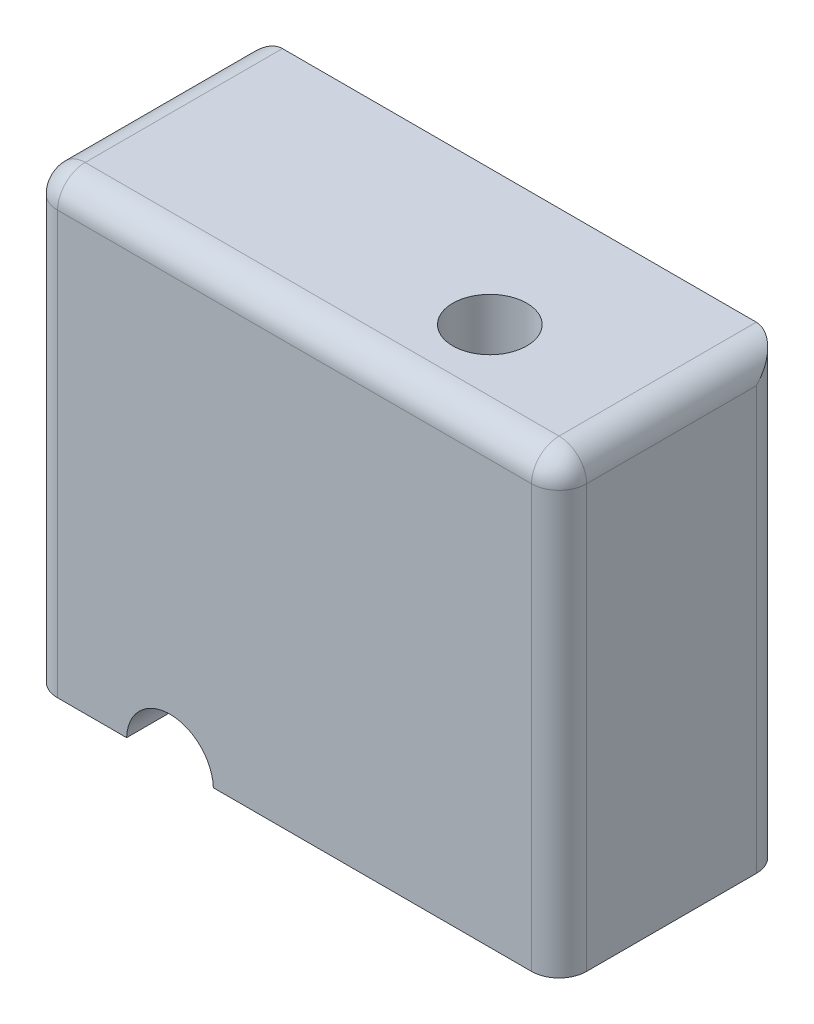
ISO-10303-21;
HEADER;
FILE_DESCRIPTION(('STEP AP214'),'2;1');
FILE_NAME('part.step','',(''),(''),'','','');
FILE_SCHEMA(('AUTOMOTIVE_DESIGN { 1 0 10303 214 1 1 1 1 }'));
ENDSEC;
DATA;
#1=APPLICATION_CONTEXT('core data for automotive mechanical design processes');
#2=APPLICATION_PROTOCOL_DEFINITION('international standard','automotive_design',2000,#1);
#3=PRODUCT_CONTEXT('',#1,'mechanical');
#4=PRODUCT('Part','Part','',(#3));
#5=PRODUCT_RELATED_PRODUCT_CATEGORY('part','',(#4));
#6=PRODUCT_DEFINITION_FORMATION('','',#4);
#7=PRODUCT_DEFINITION_CONTEXT('part definition',#1,'design');
#8=PRODUCT_DEFINITION('design','',#6,#7);
#9=PRODUCT_DEFINITION_SHAPE('','',#8);
#10=(LENGTH_UNIT() NAMED_UNIT(*) SI_UNIT(.MILLI.,.METRE.));
#11=(NAMED_UNIT(*) PLANE_ANGLE_UNIT() SI_UNIT($,.RADIAN.));
#12=(NAMED_UNIT(*) SI_UNIT($,.STERADIAN.) SOLID_ANGLE_UNIT());
#13=UNCERTAINTY_MEASURE_WITH_UNIT(LENGTH_MEASURE(1.E-05),#10,'distance_accuracy_value','');
#14=(GEOMETRIC_REPRESENTATION_CONTEXT(3) GLOBAL_UNCERTAINTY_ASSIGNED_CONTEXT((#13)) GLOBAL_UNIT_ASSIGNED_CONTEXT((#10,
#11,#12)) REPRESENTATION_CONTEXT('',''));
#15=CARTESIAN_POINT('',(0.,0.,0.));
#16=DIRECTION('',(0.,0.,1.));
#17=DIRECTION('',(1.,0.,0.));
#18=AXIS2_PLACEMENT_3D('',#15,#16,#17);
#19=CARTESIAN_POINT('',(109.215291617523,0.,90.932));
#20=DIRECTION('',(0.,-1.,0.));
#21=DIRECTION('',(0.,0.,-1.));
#22=AXIS2_PLACEMENT_3D('',#19,#20,#21);
#23=CYLINDRICAL_SURFACE('',#22,12.7);
#24=DIRECTION('',(0.,1.,0.));
#25=VECTOR('',#24,1.);
#26=CARTESIAN_POINT('',(109.215291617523,0.,103.632));
#27=LINE('',#26,#25);
#28=CARTESIAN_POINT('',(109.215291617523,-66.8581811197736,103.632));
#29=VERTEX_POINT('',#28);
#30=CARTESIAN_POINT('',(109.215291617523,127.818181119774,103.632));
#31=VERTEX_POINT('',#30);
#32=EDGE_CURVE('E39',#29,#31,#27,.T.);
#33=ORIENTED_EDGE('',*,*,#32,.F.);
#34=CARTESIAN_POINT('',(109.215291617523,-66.8581811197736,90.932));
#35=DIRECTION('',(0.,-1.,0.));
#36=DIRECTION('',(0.,0.,-1.));
#37=AXIS2_PLACEMENT_3D('',#34,#35,#36);
#38=CIRCLE('',#37,12.7);
#39=CARTESIAN_POINT('',(121.915291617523,-66.8581811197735,90.932));
#40=VERTEX_POINT('',#39);
#41=EDGE_CURVE('E482',#29,#40,#38,.F.);
#42=ORIENTED_EDGE('',*,*,#41,.T.);
#43=DIRECTION('',(0.,1.,0.));
#44=VECTOR('',#43,1.);
#45=CARTESIAN_POINT('',(121.915291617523,140.518181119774,90.932));
#46=LINE('',#45,#44);
#47=CARTESIAN_POINT('',(121.915291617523,127.818181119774,90.932));
#48=VERTEX_POINT('',#47);
#49=EDGE_CURVE('E428',#40,#48,#46,.T.);
#50=ORIENTED_EDGE('',*,*,#49,.T.);
#51=CARTESIAN_POINT('',(109.215291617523,127.818181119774,90.932));
#52=DIRECTION('',(0.,-1.,0.));
#53=DIRECTION('',(1.,0.,0.));
#54=AXIS2_PLACEMENT_3D('',#51,#52,#53);
#55=CIRCLE('',#54,12.7);
#56=EDGE_CURVE('E304',#31,#48,#55,.F.);
#57=ORIENTED_EDGE('',*,*,#56,.F.);
#58=EDGE_LOOP('',(#33,#42,#50,#57));
#59=FACE_BOUND('',#58,.T.);
#60=ADVANCED_FACE('F36',(#59),#23,.T.);
#61=CARTESIAN_POINT('',(-109.215291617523,0.,90.932));
#62=DIRECTION('',(0.,1.,0.));
#63=DIRECTION('',(-1.,0.,0.));
#64=AXIS2_PLACEMENT_3D('',#61,#62,#63);
#65=CYLINDRICAL_SURFACE('',#64,12.7);
#66=DIRECTION('',(0.,1.,0.));
#67=VECTOR('',#66,1.);
#68=CARTESIAN_POINT('',(-121.915291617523,140.518181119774,90.932));
#69=LINE('',#68,#67);
#70=CARTESIAN_POINT('',(-121.915291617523,127.818181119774,90.932));
#71=VERTEX_POINT('',#70);
#72=CARTESIAN_POINT('',(-121.915291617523,-66.8581811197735,90.932));
#73=VERTEX_POINT('',#72);
#74=EDGE_CURVE('E261',#71,#73,#69,.F.);
#75=ORIENTED_EDGE('',*,*,#74,.T.);
#76=CARTESIAN_POINT('',(-109.215291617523,-66.8581811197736,90.932));
#77=DIRECTION('',(0.,-1.,0.));
#78=DIRECTION('',(0.,0.,-1.));
#79=AXIS2_PLACEMENT_3D('',#76,#77,#78);
#80=CIRCLE('',#79,12.7);
#81=CARTESIAN_POINT('',(-109.215291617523,-66.8581811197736,103.632));
#82=VERTEX_POINT('',#81);
#83=EDGE_CURVE('E308',#73,#82,#80,.F.);
#84=ORIENTED_EDGE('',*,*,#83,.T.);
#85=DIRECTION('',(0.,1.,0.));
#86=VECTOR('',#85,1.);
#87=CARTESIAN_POINT('',(-109.215291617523,0.,103.632));
#88=LINE('',#87,#86);
#89=CARTESIAN_POINT('',(-109.215291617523,127.818181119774,103.632));
#90=VERTEX_POINT('',#89);
#91=EDGE_CURVE('E433',#90,#82,#88,.F.);
#92=ORIENTED_EDGE('',*,*,#91,.F.);
#93=CARTESIAN_POINT('',(-109.215291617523,127.818181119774,90.932));
#94=DIRECTION('',(0.,1.,0.));
#95=DIRECTION('',(-1.,0.,0.));
#96=AXIS2_PLACEMENT_3D('',#93,#94,#95);
#97=CIRCLE('',#96,12.7);
#98=EDGE_CURVE('E307',#90,#71,#97,.F.);
#99=ORIENTED_EDGE('',*,*,#98,.T.);
#100=EDGE_LOOP('',(#75,#84,#92,#99));
#101=FACE_BOUND('',#100,.T.);
#102=ADVANCED_FACE('F279',(#101),#65,.T.);
#103=CARTESIAN_POINT('',(0.,0.,103.632));
#104=DIRECTION('',(0.,0.,1.));
#105=DIRECTION('',(1.,0.,0.));
#106=AXIS2_PLACEMENT_3D('',#103,#104,#105);
#107=PLANE('',#106);
#108=ORIENTED_EDGE('',*,*,#91,.T.);
#109=DIRECTION('',(1.,0.,0.));
#110=VECTOR('',#109,1.);
#111=CARTESIAN_POINT('',(0.,-66.8581811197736,103.632));
#112=LINE('',#111,#110);
#113=CARTESIAN_POINT('',(-77.4087429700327,-66.8581811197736,103.632));
#114=VERTEX_POINT('',#113);
#115=EDGE_CURVE('E379',#82,#114,#112,.T.);
#116=ORIENTED_EDGE('',*,*,#115,.T.);
#117=CARTESIAN_POINT('',(-57.4183825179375,-67.4790587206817,103.632));
#118=DIRECTION('',(0.,0.,1.));
#119=DIRECTION('',(1.,0.,0.));
#120=AXIS2_PLACEMENT_3D('',#117,#118,#119);
#121=CIRCLE('',#120,20.);
#122=CARTESIAN_POINT('',(-37.4280220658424,-66.8581811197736,103.632));
#123=VERTEX_POINT('',#122);
#124=EDGE_CURVE('E263',#114,#123,#121,.F.);
#125=ORIENTED_EDGE('',*,*,#124,.T.);
#126=EDGE_CURVE('E451',#123,#29,#112,.T.);
#127=ORIENTED_EDGE('',*,*,#126,.T.);
#128=ORIENTED_EDGE('',*,*,#32,.T.);
#129=DIRECTION('',(1.,0.,0.));
#130=VECTOR('',#129,1.);
#131=CARTESIAN_POINT('',(0.,127.818181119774,103.632));
#132=LINE('',#131,#130);
#133=EDGE_CURVE('E296',#90,#31,#132,.T.);
#134=ORIENTED_EDGE('',*,*,#133,.F.);
#135=EDGE_LOOP('',(#108,#116,#125,#127,#128,#134));
#136=FACE_BOUND('',#135,.T.);
#137=ADVANCED_FACE('F275',(#136),#107,.T.);
#138=CARTESIAN_POINT('',(-57.4183825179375,-67.4790587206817,103.632));
#139=DIRECTION('',(0.,0.,1.));
#140=DIRECTION('',(1.,0.,0.));
#141=AXIS2_PLACEMENT_3D('',#138,#139,#140);
#142=CYLINDRICAL_SURFACE('',#141,20.);
#143=DIRECTION('',(0.,0.,1.));
#144=VECTOR('',#143,1.);
#145=CARTESIAN_POINT('',(-37.4280220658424,-66.8581811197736,103.632));
#146=LINE('',#145,#144);
#147=CARTESIAN_POINT('',(-37.4280220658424,-66.8581811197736,83.632));
#148=VERTEX_POINT('',#147);
#149=EDGE_CURVE('E354',#123,#148,#146,.F.);
#150=ORIENTED_EDGE('',*,*,#149,.F.);
#151=ORIENTED_EDGE('',*,*,#124,.F.);
#152=DIRECTION('',(0.,0.,1.));
#153=VECTOR('',#152,1.);
#154=CARTESIAN_POINT('',(-77.4087429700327,-66.8581811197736,103.632));
#155=LINE('',#154,#153);
#156=CARTESIAN_POINT('',(-77.4087429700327,-66.8581811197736,83.632));
#157=VERTEX_POINT('',#156);
#158=EDGE_CURVE('E356',#157,#114,#155,.T.);
#159=ORIENTED_EDGE('',*,*,#158,.F.);
#160=CARTESIAN_POINT('',(-57.4183825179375,-67.4790587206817,83.632));
#161=DIRECTION('',(0.,0.,1.));
#162=DIRECTION('',(1.,0.,0.));
#163=AXIS2_PLACEMENT_3D('',#160,#161,#162);
#164=CIRCLE('',#163,20.);
#165=EDGE_CURVE('E260',#157,#148,#164,.F.);
#166=ORIENTED_EDGE('',*,*,#165,.T.);
#167=EDGE_LOOP('',(#150,#151,#159,#166));
#168=FACE_BOUND('',#167,.T.);
#169=ADVANCED_FACE('F270',(#168),#142,.F.);
#170=CARTESIAN_POINT('',(47.6899765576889,-61.5571991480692,59.4690900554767));
#171=DIRECTION('',(-0.342020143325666,0.,-0.939692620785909));
#172=DIRECTION('',(-0.939692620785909,0.,0.342020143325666));
#173=AXIS2_PLACEMENT_3D('',#170,#171,#172);
#174=CYLINDRICAL_SURFACE('',#173,15.24);
#175=DIRECTION('',(-0.342020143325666,0.,-0.939692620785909));
#176=VECTOR('',#175,1.);
#177=CARTESIAN_POINT('',(34.2633114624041,-66.8581811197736,64.3559964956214));
#178=LINE('',#177,#176);
#179=CARTESIAN_POINT('',(7.7670109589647,-66.8581811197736,-8.44199083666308));
#180=VERTEX_POINT('',#179);
#181=CARTESIAN_POINT('',(32.1303095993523,-66.8581811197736,58.4956220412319));
#182=VERTEX_POINT('',#181);
#183=EDGE_CURVE('E477',#180,#182,#178,.F.);
#184=ORIENTED_EDGE('',*,*,#183,.F.);
#185=CARTESIAN_POINT('',(21.1936760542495,-61.5571991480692,-13.3288972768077));
#186=DIRECTION('',(-0.342020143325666,0.,-0.939692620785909));
#187=DIRECTION('',(-0.939692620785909,0.,0.342020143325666));
#188=AXIS2_PLACEMENT_3D('',#185,#186,#187);
#189=CIRCLE('',#188,15.24);
#190=CARTESIAN_POINT('',(34.6203411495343,-66.8581811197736,-18.2158037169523));
#191=VERTEX_POINT('',#190);
#192=EDGE_CURVE('E222',#180,#191,#189,.T.);
#193=ORIENTED_EDGE('',*,*,#192,.T.);
#194=DIRECTION('',(-0.342020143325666,0.,-0.939692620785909));
#195=VECTOR('',#194,1.);
#196=CARTESIAN_POINT('',(61.1166416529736,-66.8581811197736,54.5821836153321));
#197=LINE('',#196,#195);
#198=CARTESIAN_POINT('',(58.9836397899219,-66.8581811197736,48.7218091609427));
#199=VERTEX_POINT('',#198);
#200=EDGE_CURVE('E486',#199,#191,#197,.T.);
#201=ORIENTED_EDGE('',*,*,#200,.F.);
#202=CARTESIAN_POINT('',(48.7489598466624,-75.6350887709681,45.3123627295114));
#203=CARTESIAN_POINT('',(49.1858469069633,-75.4648674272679,45.3123657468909));
#204=CARTESIAN_POINT('',(49.6166205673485,-75.2783408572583,45.3291696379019));
#205=CARTESIAN_POINT('',(50.4623529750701,-74.8763709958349,45.3932835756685));
#206=CARTESIAN_POINT('',(50.8772950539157,-74.6608982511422,45.4406248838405));
#207=CARTESIAN_POINT('',(51.6905838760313,-74.2033810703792,45.5627402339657));
#208=CARTESIAN_POINT('',(52.0888443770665,-73.9612176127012,45.6376409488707));
#209=CARTESIAN_POINT('',(52.8648720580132,-73.4541007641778,45.8113470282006));
#210=CARTESIAN_POINT('',(53.2426433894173,-73.1891520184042,45.9101475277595));
#211=CARTESIAN_POINT('',(54.0532668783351,-72.5812161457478,46.1510023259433));
#212=CARTESIAN_POINT('',(54.4811585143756,-72.2334830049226,46.2977804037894));
#213=CARTESIAN_POINT('',(55.3039109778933,-71.5107111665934,46.6152368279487));
#214=CARTESIAN_POINT('',(55.6987572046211,-71.1356605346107,46.7859256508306));
#215=CARTESIAN_POINT('',(56.4530646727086,-70.3602922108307,47.1445121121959));
#216=CARTESIAN_POINT('',(56.8125723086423,-69.9600088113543,47.3323865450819));
#217=CARTESIAN_POINT('',(57.4943617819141,-69.1336893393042,47.7181937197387));
#218=CARTESIAN_POINT('',(57.8166641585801,-68.7076676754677,47.9161208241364));
#219=CARTESIAN_POINT('',(58.2818198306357,-68.0294301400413,48.2216380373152));
#220=CARTESIAN_POINT('',(58.4392221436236,-67.7870335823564,48.3290599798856));
#221=CARTESIAN_POINT('',(58.7409444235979,-67.2934580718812,48.5420226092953));
#222=CARTESIAN_POINT('',(58.8852672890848,-67.0422810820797,48.6475637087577));
#223=CARTESIAN_POINT('',(59.1594292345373,-66.5305352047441,48.8542440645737));
#224=CARTESIAN_POINT('',(59.2892755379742,-66.2699710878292,48.9553855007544));
#225=CARTESIAN_POINT('',(59.5326728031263,-65.7385890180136,49.1501297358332));
#226=CARTESIAN_POINT('',(59.646227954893,-65.4677737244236,49.2437344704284));
#227=CARTESIAN_POINT('',(59.8289944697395,-64.983010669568,49.3978417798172));
#228=CARTESIAN_POINT('',(59.9022538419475,-64.7713865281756,49.4608356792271));
#229=CARTESIAN_POINT('',(60.036698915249,-64.3419044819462,49.5781486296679));
#230=CARTESIAN_POINT('',(60.09788367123,-64.1240460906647,49.6324670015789));
#231=CARTESIAN_POINT('',(60.2064674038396,-63.6831991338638,49.7299835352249));
#232=CARTESIAN_POINT('',(60.2539097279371,-63.4602291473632,49.7732166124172));
#233=CARTESIAN_POINT('',(60.3336969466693,-63.0095490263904,49.8465015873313));
#234=CARTESIAN_POINT('',(60.3660523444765,-62.781842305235,49.8765626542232));
#235=CARTESIAN_POINT('',(60.407612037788,-62.3877907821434,49.9153322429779));
#236=CARTESIAN_POINT('',(60.4207689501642,-62.2222097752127,49.9276689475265));
#237=CARTESIAN_POINT('',(60.4383535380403,-61.8901601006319,49.9441766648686));
#238=CARTESIAN_POINT('',(60.4427804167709,-61.7236913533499,49.9483469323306));
#239=CARTESIAN_POINT('',(60.4427723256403,-61.3239555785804,49.9483359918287));
#240=CARTESIAN_POINT('',(60.4340728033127,-61.0906659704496,49.940136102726));
#241=CARTESIAN_POINT('',(60.3996735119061,-60.6263568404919,49.9079119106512));
#242=CARTESIAN_POINT('',(60.3739627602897,-60.3953388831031,49.8838773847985));
#243=CARTESIAN_POINT('',(60.3065566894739,-59.936916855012,49.8215020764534));
#244=CARTESIAN_POINT('',(60.2648122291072,-59.7095261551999,49.7831173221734));
#245=CARTESIAN_POINT('',(60.1668495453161,-59.2602583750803,49.6942468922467));
#246=CARTESIAN_POINT('',(60.1106241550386,-59.0383840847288,49.643755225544));
#247=CARTESIAN_POINT('',(59.9558628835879,-58.4980314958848,49.5070420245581));
#248=CARTESIAN_POINT('',(59.8498578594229,-58.1831251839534,49.415177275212));
#249=CARTESIAN_POINT('',(59.6145349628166,-57.5667746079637,49.2173101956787));
#250=CARTESIAN_POINT('',(59.4852016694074,-57.2653394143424,49.1112985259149));
#251=CARTESIAN_POINT('',(59.2062593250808,-56.6742891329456,48.8903357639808));
#252=CARTESIAN_POINT('',(59.0565910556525,-56.3847119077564,48.7753589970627));
#253=CARTESIAN_POINT('',(58.739750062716,-55.8172818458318,48.5409861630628));
#254=CARTESIAN_POINT('',(58.5725793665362,-55.5394276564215,48.4215906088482));
#255=CARTESIAN_POINT('',(58.2510205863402,-55.0389658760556,48.2011885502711));
#256=CARTESIAN_POINT('',(58.0990033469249,-54.8147462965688,48.1003631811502));
#257=CARTESIAN_POINT('',(57.7845920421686,-54.3733975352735,47.8993467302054));
#258=CARTESIAN_POINT('',(57.6221968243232,-54.1562691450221,47.7991557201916));
#259=CARTESIAN_POINT('',(57.1201277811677,-53.514879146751,47.5013914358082));
#260=CARTESIAN_POINT('',(56.7656543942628,-53.1007417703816,47.306685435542));
#261=CARTESIAN_POINT('',(56.0203886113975,-52.2989903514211,46.9333156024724));
#262=CARTESIAN_POINT('',(55.6296020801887,-51.9113720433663,46.7546491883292));
#263=CARTESIAN_POINT('',(54.8135560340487,-51.1636603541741,46.4201688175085));
#264=CARTESIAN_POINT('',(54.3883092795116,-50.8035568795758,46.2643464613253));
#265=CARTESIAN_POINT('',(53.5588405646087,-50.1554628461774,45.9991197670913));
#266=CARTESIAN_POINT('',(53.1583774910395,-49.8640332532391,45.8863722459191));
#267=CARTESIAN_POINT('',(52.3334052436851,-49.3069113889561,45.6876383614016));
#268=CARTESIAN_POINT('',(51.9088935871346,-49.0412217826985,45.6016547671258));
#269=CARTESIAN_POINT('',(51.0390723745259,-48.5397783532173,45.4609929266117));
#270=CARTESIAN_POINT('',(50.5938235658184,-48.3039437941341,45.4062287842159));
#271=CARTESIAN_POINT('',(49.684454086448,-47.8655504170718,45.3319259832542));
#272=CARTESIAN_POINT('',(49.2203441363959,-47.6629730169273,45.3123675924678));
#273=CARTESIAN_POINT('',(48.4359503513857,-47.3573529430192,45.3123595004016));
#274=CARTESIAN_POINT('',(48.1197334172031,-47.2437359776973,45.3209779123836));
#275=CARTESIAN_POINT('',(47.4824285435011,-47.0345136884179,45.3564344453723));
#276=CARTESIAN_POINT('',(47.1613419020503,-46.9389036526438,45.3832677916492));
#277=CARTESIAN_POINT('',(46.5162819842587,-46.7670225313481,45.4559255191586));
#278=CARTESIAN_POINT('',(46.1923100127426,-46.6907431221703,45.5017417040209));
#279=CARTESIAN_POINT('',(45.5435008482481,-46.55862908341,45.6128667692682));
#280=CARTESIAN_POINT('',(45.2186636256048,-46.5027951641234,45.6781763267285));
#281=CARTESIAN_POINT('',(44.569129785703,-46.4123111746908,45.8287627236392));
#282=CARTESIAN_POINT('',(44.244439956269,-46.3777545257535,45.9141253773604));
#283=CARTESIAN_POINT('',(43.5992025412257,-46.3308266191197,46.1043990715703));
#284=CARTESIAN_POINT('',(43.2786549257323,-46.3184552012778,46.209309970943));
#285=CARTESIAN_POINT('',(42.644286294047,-46.3161250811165,46.4379869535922));
#286=CARTESIAN_POINT('',(42.3304650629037,-46.3261656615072,46.561752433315));
#287=CARTESIAN_POINT('',(41.7119786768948,-46.3684734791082,46.827052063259));
#288=CARTESIAN_POINT('',(41.4073133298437,-46.4007402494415,46.9685858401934));
#289=CARTESIAN_POINT('',(40.8233478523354,-46.4848944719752,47.2609675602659));
#290=CARTESIAN_POINT('',(40.5435282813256,-46.5357904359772,47.4110670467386));
#291=CARTESIAN_POINT('',(39.995756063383,-46.6564547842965,47.7246725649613));
#292=CARTESIAN_POINT('',(39.7278029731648,-46.7262224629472,47.8881780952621));
#293=CARTESIAN_POINT('',(39.2049399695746,-46.8836558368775,48.2270853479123));
#294=CARTESIAN_POINT('',(38.9500329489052,-46.9713254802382,48.4024896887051));
#295=CARTESIAN_POINT('',(38.4541950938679,-47.1634356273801,48.763589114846));
#296=CARTESIAN_POINT('',(38.213266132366,-47.2678783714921,48.9492855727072));
#297=CARTESIAN_POINT('',(37.7282030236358,-47.5008875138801,49.3438542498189));
#298=CARTESIAN_POINT('',(37.4852211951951,-47.6306851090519,49.5534145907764));
#299=CARTESIAN_POINT('',(37.0165262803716,-47.9068301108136,49.9807266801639));
#300=CARTESIAN_POINT('',(36.7908136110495,-48.0531779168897,50.1984786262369));
#301=CARTESIAN_POINT('',(36.3567591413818,-48.3609753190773,50.6403737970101));
#302=CARTESIAN_POINT('',(36.1484136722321,-48.5224217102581,50.8645156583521));
#303=CARTESIAN_POINT('',(35.7488392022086,-48.8591595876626,51.3176377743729));
#304=CARTESIAN_POINT('',(35.5576138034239,-49.0344539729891,51.5466190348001));
#305=CARTESIAN_POINT('',(35.0942872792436,-49.4947618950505,52.1311371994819));
#306=CARTESIAN_POINT('',(34.8335328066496,-49.7883759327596,52.4889544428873));
#307=CARTESIAN_POINT('',(34.3497873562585,-50.4020533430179,53.20753617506));
#308=CARTESIAN_POINT('',(34.126814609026,-50.7221293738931,53.5683019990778));
#309=CARTESIAN_POINT('',(33.7155210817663,-51.387992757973,54.2899712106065));
#310=CARTESIAN_POINT('',(33.5273915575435,-51.7339081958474,54.6508650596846));
#311=CARTESIAN_POINT('',(33.1850256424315,-52.4484000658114,55.365900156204));
#312=CARTESIAN_POINT('',(33.0307794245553,-52.8169698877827,55.7200433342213));
#313=CARTESIAN_POINT('',(32.7502165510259,-53.5862942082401,56.4250751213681));
#314=CARTESIAN_POINT('',(32.6247015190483,-53.9876256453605,56.775656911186));
#315=CARTESIAN_POINT('',(32.4591696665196,-54.6085173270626,57.2862603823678));
#316=CARTESIAN_POINT('',(32.4077558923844,-54.8187764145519,57.4540231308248));
#317=CARTESIAN_POINT('',(32.3121867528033,-55.2458883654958,57.7830783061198));
#318=CARTESIAN_POINT('',(32.2680303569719,-55.4627402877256,57.9443716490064));
#319=CARTESIAN_POINT('',(32.1868867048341,-55.9019316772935,58.2578226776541));
#320=CARTESIAN_POINT('',(32.1498515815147,-56.124222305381,58.4100362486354));
#321=CARTESIAN_POINT('',(32.0821772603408,-56.5762770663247,58.7046031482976));
#322=CARTESIAN_POINT('',(32.0515391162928,-56.8060424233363,58.8469548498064));
#323=CARTESIAN_POINT('',(31.9963105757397,-57.2730383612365,59.1189918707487));
#324=CARTESIAN_POINT('',(31.9717074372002,-57.5102519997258,59.2487035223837));
#325=CARTESIAN_POINT('',(31.928031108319,-57.9929363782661,59.4926342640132));
#326=CARTESIAN_POINT('',(31.9089549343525,-58.2384025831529,59.6068616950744));
#327=CARTESIAN_POINT('',(31.8788539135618,-58.6924431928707,59.7970941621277));
#328=CARTESIAN_POINT('',(31.866996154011,-58.8996268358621,59.8762736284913));
#329=CARTESIAN_POINT('',(31.8463990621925,-59.3194259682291,60.0194054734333));
#330=CARTESIAN_POINT('',(31.8376600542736,-59.5320420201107,60.0833562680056));
#331=CARTESIAN_POINT('',(31.823089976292,-59.961088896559,60.1933902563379));
#332=CARTESIAN_POINT('',(31.817247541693,-60.1775013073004,60.2395431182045));
#333=CARTESIAN_POINT('',(31.8082245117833,-60.613576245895,60.3122044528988));
#334=CARTESIAN_POINT('',(31.8050418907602,-60.8332361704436,60.3387278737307));
#335=CARTESIAN_POINT('',(31.8023984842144,-61.1373779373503,60.3608733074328));
#336=CARTESIAN_POINT('',(31.8018535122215,-61.2212623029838,60.3654590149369));
#337=CARTESIAN_POINT('',(31.801127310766,-61.3891595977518,60.3715824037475));
#338=CARTESIAN_POINT('',(31.8009461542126,-61.47317254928,60.3731194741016));
#339=CARTESIAN_POINT('',(31.800945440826,-61.7903374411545,60.3731076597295));
#340=CARTESIAN_POINT('',(31.8023380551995,-62.0235807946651,60.3612420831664));
#341=CARTESIAN_POINT('',(31.8079731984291,-62.4878104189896,60.3144698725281));
#342=CARTESIAN_POINT('',(31.8122180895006,-62.7187946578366,60.2795441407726));
#343=CARTESIAN_POINT('',(31.8237579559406,-63.1772353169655,60.1884480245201));
#344=CARTESIAN_POINT('',(31.8310633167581,-63.4046769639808,60.13220536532));
#345=CARTESIAN_POINT('',(31.8489846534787,-63.854044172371,60.0011376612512));
#346=CARTESIAN_POINT('',(31.8596022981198,-64.0759668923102,59.926303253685));
#347=CARTESIAN_POINT('',(31.8902812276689,-64.6163624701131,59.7220797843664));
#348=CARTESIAN_POINT('',(31.9124359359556,-64.9312651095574,59.5835705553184));
#349=CARTESIAN_POINT('',(31.9655167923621,-65.5476137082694,59.2807348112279));
#350=CARTESIAN_POINT('',(31.9964489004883,-65.8490503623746,59.116390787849));
#351=CARTESIAN_POINT('',(32.0680993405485,-66.4401048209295,58.7678207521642));
#352=CARTESIAN_POINT('',(32.1088465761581,-66.7296847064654,58.5835369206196));
#353=CARTESIAN_POINT('',(32.2009092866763,-67.2971170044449,58.2003339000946));
#354=CARTESIAN_POINT('',(32.2522234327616,-67.5749708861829,58.0014165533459));
#355=CARTESIAN_POINT('',(32.3569022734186,-68.0755389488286,57.6258050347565));
#356=CARTESIAN_POINT('',(32.408570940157,-68.299861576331,57.4507699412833));
#357=CARTESIAN_POINT('',(32.5202730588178,-68.7414099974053,57.0945104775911));
#358=CARTESIAN_POINT('',(32.5803074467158,-68.9586349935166,56.9132854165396));
#359=CARTESIAN_POINT('',(32.7736344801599,-69.6003188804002,56.3621784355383));
#360=CARTESIAN_POINT('',(32.9201216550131,-70.0146442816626,55.9849736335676));
#361=CARTESIAN_POINT('',(33.2511148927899,-70.8163712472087,55.219860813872));
#362=CARTESIAN_POINT('',(33.4355796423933,-71.2038014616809,54.8319648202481));
#363=CARTESIAN_POINT('',(33.8455601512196,-71.9511315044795,54.0515559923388));
#364=CARTESIAN_POINT('',(34.0710559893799,-72.3110445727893,53.6590454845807));
#365=CARTESIAN_POINT('',(34.5066927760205,-72.9183105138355,52.9690831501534));
#366=CARTESIAN_POINT('',(34.7076035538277,-73.1719941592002,52.6713523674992));
#367=CARTESIAN_POINT('',(35.1359472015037,-73.6603292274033,52.0792741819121));
#368=CARTESIAN_POINT('',(35.363379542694,-73.8949810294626,51.784926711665));
#369=CARTESIAN_POINT('',(35.8453130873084,-74.3427910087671,51.2029489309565));
#370=CARTESIAN_POINT('',(36.0997763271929,-74.5559785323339,50.915309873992));
#371=CARTESIAN_POINT('',(36.6365411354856,-74.958667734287,50.3495543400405));
#372=CARTESIAN_POINT('',(36.9188367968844,-75.1481744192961,50.0714358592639));
#373=CARTESIAN_POINT('',(37.4539118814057,-75.4665591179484,49.5808019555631));
#374=CARTESIAN_POINT('',(37.7018432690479,-75.6000748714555,49.3660002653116));
#375=CARTESIAN_POINT('',(38.2153785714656,-75.8482472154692,48.9469187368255));
#376=CARTESIAN_POINT('',(38.4809787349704,-75.9629077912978,48.7426366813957));
#377=CARTESIAN_POINT('',(39.0289882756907,-76.1717611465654,48.346745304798));
#378=CARTESIAN_POINT('',(39.311390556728,-76.265962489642,48.1551307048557));
#379=CARTESIAN_POINT('',(39.891855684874,-76.432472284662,47.7866007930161));
#380=CARTESIAN_POINT('',(40.1899186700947,-76.5047805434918,47.6096856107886));
#381=CARTESIAN_POINT('',(40.8016881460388,-76.6265761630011,47.2716404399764));
#382=CARTESIAN_POINT('',(41.1154742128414,-76.6759309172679,47.1106063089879));
#383=CARTESIAN_POINT('',(41.7548299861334,-76.7502546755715,46.8073494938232));
#384=CARTESIAN_POINT('',(42.0803998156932,-76.7752234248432,46.6651270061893));
#385=CARTESIAN_POINT('',(42.7406959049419,-76.8002712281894,46.4009989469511));
#386=CARTESIAN_POINT('',(43.0754240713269,-76.8003450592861,46.2790976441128));
#387=CARTESIAN_POINT('',(43.7509928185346,-76.7755865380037,46.0567359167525));
#388=CARTESIAN_POINT('',(44.0918328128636,-76.7507565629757,45.9562734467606));
#389=CARTESIAN_POINT('',(44.7446337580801,-76.6801619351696,45.7856842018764));
#390=CARTESIAN_POINT('',(45.0563237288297,-76.6365654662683,45.7136021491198));
#391=CARTESIAN_POINT('',(45.6800579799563,-76.5300137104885,45.5875448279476));
#392=CARTESIAN_POINT('',(45.9921022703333,-76.4670578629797,45.5335700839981));
#393=CARTESIAN_POINT('',(46.6140065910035,-76.3228316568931,45.4435168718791));
#394=CARTESIAN_POINT('',(46.9238691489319,-76.2415882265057,45.4074123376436));
#395=CARTESIAN_POINT('',(47.5399732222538,-76.0618492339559,45.3524318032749));
#396=CARTESIAN_POINT('',(47.8462161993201,-75.9633609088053,45.3335485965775));
#397=CARTESIAN_POINT('',(48.2503105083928,-75.8216179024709,45.3193526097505));
#398=CARTESIAN_POINT('',(48.3504925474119,-75.7854993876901,45.3167227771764));
#399=CARTESIAN_POINT('',(48.5502079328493,-75.7115633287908,45.3132278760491));
#400=CARTESIAN_POINT('',(48.6497415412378,-75.6737465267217,45.3123620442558));
#401=CARTESIAN_POINT('',(48.7489598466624,-75.6350887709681,45.3123627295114));
#402=B_SPLINE_CURVE_WITH_KNOTS('',3,(#202,#203,#204,#205,#206,#207,#208,#209,#210,#211,#212,
#213,#214,#215,#216,#217,#218,#219,#220,#221,#222,#223,#224,#225,#226,#227,#228,#229,#230,#231,
#232,#233,#234,#235,#236,#237,#238,#239,#240,#241,#242,#243,#244,#245,#246,#247,#248,#249,#250,
#251,#252,#253,#254,#255,#256,#257,#258,#259,#260,#261,#262,#263,#264,#265,#266,#267,#268,#269,
#270,#271,#272,#273,#274,#275,#276,#277,#278,#279,#280,#281,#282,#283,#284,#285,#286,#287,#288,
#289,#290,#291,#292,#293,#294,#295,#296,#297,#298,#299,#300,#301,#302,#303,#304,#305,#306,#307,
#308,#309,#310,#311,#312,#313,#314,#315,#316,#317,#318,#319,#320,#321,#322,#323,#324,#325,#326,
#327,#328,#329,#330,#331,#332,#333,#334,#335,#336,#337,#338,#339,#340,#341,#342,#343,#344,#345,
#346,#347,#348,#349,#350,#351,#352,#353,#354,#355,#356,#357,#358,#359,#360,#361,#362,#363,#364,
#365,#366,#367,#368,#369,#370,#371,#372,#373,#374,#375,#376,#377,#378,#379,#380,#381,#382,#383,
#384,#385,#386,#387,#388,#389,#390,#391,#392,#393,#394,#395,#396,#397,#398,#399,#400,#401),
.UNSPECIFIED.,.T.,.F.,(4,2,2,2,2,2,2,2,2,2,2,2,2,2,2,2,2,2,2,2,2,2,2,2,2,2,2,2,2,2,2,2,2,2,2,2,
2,2,2,2,2,2,2,2,2,2,2,2,2,2,2,2,2,2,2,2,2,2,2,2,2,2,2,2,2,2,2,2,2,2,2,2,2,2,2,2,2,2,2,2,2,2,2,2,
2,2,2,2,2,2,2,2,2,2,2,2,2,2,2,4),(0.,1.40649836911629,2.81443887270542,4.2289333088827,
5.64314006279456,7.35251655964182,9.06264438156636,10.7704961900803,12.4774006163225,
13.4020828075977,14.3265595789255,15.2505729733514,16.1743482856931,16.8717928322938,
17.5692919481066,18.264566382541,18.9593560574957,19.4586333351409,19.9579561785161,
20.657471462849,21.3574387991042,22.0595687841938,22.7620469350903,23.7944627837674,
24.8275636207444,25.8637402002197,26.8997968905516,27.7666575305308,28.6336146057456,
30.3680211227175,32.1021480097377,33.835635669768,35.357752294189,36.8800263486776,
38.3980916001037,39.9153057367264,40.9227691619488,41.9299685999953,42.9367336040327,
43.9435335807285,44.954723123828,45.9659053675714,46.9770552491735,47.9881838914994,
48.9518770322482,49.9155341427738,50.8794040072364,51.8434027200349,52.8807894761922,
53.9182012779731,54.9553933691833,55.9928031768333,57.5842337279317,59.1764300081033,
60.7771224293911,62.3773499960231,64.0178964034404,64.8392626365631,65.6605121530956,
66.4760321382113,67.2916863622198,68.1056033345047,68.919080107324,69.584904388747,
70.2507978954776,70.9140577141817,71.5768119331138,71.8288005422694,72.0808396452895,
72.7801416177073,73.4800234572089,74.1822997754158,74.8849304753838,75.9173333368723,
76.9504389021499,77.9866247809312,79.022680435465,79.8899460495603,80.7573087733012,
82.4925774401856,84.2259683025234,85.9585198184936,87.276627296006,88.5947085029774,
89.9109624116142,91.2269375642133,92.288442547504,93.3497228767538,94.4105581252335,
95.4714027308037,96.5383021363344,97.6052126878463,98.6723470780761,99.739379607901,
100.70690657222,101.674461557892,102.640601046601,103.606336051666,103.925894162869,
104.245313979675),.UNSPECIFIED.);
#403=EDGE_CURVE('E253',#199,#182,#402,.T.);
#404=ORIENTED_EDGE('',*,*,#403,.T.);
#405=EDGE_LOOP('',(#184,#193,#201,#404));
#406=FACE_BOUND('',#405,.T.);
#407=ADVANCED_FACE('F264',(#406),#174,.F.);
#408=CARTESIAN_POINT('',(121.915291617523,140.518181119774,103.632));
#409=DIRECTION('',(-1.,0.,0.));
#410=DIRECTION('',(0.,0.,1.));
#411=AXIS2_PLACEMENT_3D('',#408,#409,#410);
#412=PLANE('',#411);
#413=DIRECTION('',(0.,0.,1.));
#414=VECTOR('',#413,1.);
#415=CARTESIAN_POINT('',(121.915291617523,-66.8581811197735,103.632));
#416=LINE('',#415,#414);
#417=CARTESIAN_POINT('',(121.915291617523,-66.8581811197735,12.7));
#418=VERTEX_POINT('',#417);
#419=EDGE_CURVE('E488',#418,#40,#416,.T.);
#420=ORIENTED_EDGE('',*,*,#419,.F.);
#421=DIRECTION('',(0.,1.,0.));
#422=VECTOR('',#421,1.);
#423=CARTESIAN_POINT('',(121.915291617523,140.518181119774,12.7));
#424=LINE('',#423,#422);
#425=CARTESIAN_POINT('',(121.915291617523,127.818181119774,12.7));
#426=VERTEX_POINT('',#425);
#427=EDGE_CURVE('E197',#426,#418,#424,.F.);
#428=ORIENTED_EDGE('',*,*,#427,.F.);
#429=DIRECTION('',(0.,0.,-1.));
#430=VECTOR('',#429,1.);
#431=CARTESIAN_POINT('',(121.915291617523,127.818181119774,103.632));
#432=LINE('',#431,#430);
#433=EDGE_CURVE('E420',#48,#426,#432,.T.);
#434=ORIENTED_EDGE('',*,*,#433,.F.);
#435=ORIENTED_EDGE('',*,*,#49,.F.);
#436=EDGE_LOOP('',(#420,#428,#434,#435));
#437=FACE_BOUND('',#436,.T.);
#438=ADVANCED_FACE('F269',(#437),#412,.F.);
#439=CARTESIAN_POINT('',(-121.915291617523,140.518181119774,103.632));
#440=DIRECTION('',(1.,0.,0.));
#441=DIRECTION('',(0.,1.,0.));
#442=AXIS2_PLACEMENT_3D('',#439,#440,#441);
#443=PLANE('',#442);
#444=DIRECTION('',(0.,0.,-1.));
#445=VECTOR('',#444,1.);
#446=CARTESIAN_POINT('',(-121.915291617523,-66.8581811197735,103.632));
#447=LINE('',#446,#445);
#448=CARTESIAN_POINT('',(-121.915291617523,-66.8581811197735,12.7));
#449=VERTEX_POINT('',#448);
#450=EDGE_CURVE('E370',#73,#449,#447,.T.);
#451=ORIENTED_EDGE('',*,*,#450,.F.);
#452=ORIENTED_EDGE('',*,*,#74,.F.);
#453=DIRECTION('',(0.,0.,1.));
#454=VECTOR('',#453,1.);
#455=CARTESIAN_POINT('',(-121.915291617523,127.818181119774,103.632));
#456=LINE('',#455,#454);
#457=CARTESIAN_POINT('',(-121.915291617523,127.818181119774,12.7));
#458=VERTEX_POINT('',#457);
#459=EDGE_CURVE('E225',#458,#71,#456,.T.);
#460=ORIENTED_EDGE('',*,*,#459,.F.);
#461=DIRECTION('',(0.,-1.,0.));
#462=VECTOR('',#461,1.);
#463=CARTESIAN_POINT('',(-121.915291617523,140.518181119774,12.7));
#464=LINE('',#463,#462);
#465=EDGE_CURVE('E338',#449,#458,#464,.F.);
#466=ORIENTED_EDGE('',*,*,#465,.F.);
#467=EDGE_LOOP('',(#451,#452,#460,#466));
#468=FACE_BOUND('',#467,.T.);
#469=ADVANCED_FACE('F249',(#468),#443,.F.);
#470=CARTESIAN_POINT('',(48.7489598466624,-140.518181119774,62.3786227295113));
#471=DIRECTION('',(0.,-1.,0.));
#472=DIRECTION('',(0.,0.,-1.));
#473=AXIS2_PLACEMENT_3D('',#470,#471,#472);
#474=CYLINDRICAL_SURFACE('',#473,17.06626);
#475=CARTESIAN_POINT('',(48.7489598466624,140.518181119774,62.3786227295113));
#476=DIRECTION('',(0.,-1.,0.));
#477=DIRECTION('',(0.,0.,-1.));
#478=AXIS2_PLACEMENT_3D('',#475,#476,#477);
#479=CIRCLE('',#478,17.06626);
#480=CARTESIAN_POINT('',(48.7489598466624,140.518181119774,45.3123627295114));
#481=VERTEX_POINT('',#480);
#482=EDGE_CURVE('E216',#481,#481,#479,.F.);
#483=ORIENTED_EDGE('',*,*,#482,.T.);
#484=EDGE_LOOP('',(#483));
#485=FACE_BOUND('',#484,.T.);
#486=CARTESIAN_POINT('',(48.7489598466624,-66.8581811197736,62.3786227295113));
#487=DIRECTION('',(0.,-1.,0.));
#488=DIRECTION('',(0.,0.,-1.));
#489=AXIS2_PLACEMENT_3D('',#486,#487,#488);
#490=CIRCLE('',#489,17.06626);
#491=EDGE_CURVE('E480',#182,#199,#490,.F.);
#492=ORIENTED_EDGE('',*,*,#491,.F.);
#493=ORIENTED_EDGE('',*,*,#403,.F.);
#494=EDGE_LOOP('',(#492,#493));
#495=FACE_BOUND('',#494,.T.);
#496=ADVANCED_FACE('F244',(#485,#495),#474,.F.);
#497=CARTESIAN_POINT('',(-47.4183825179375,-67.4790587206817,83.632));
#498=DIRECTION('',(0.,0.,-1.));
#499=DIRECTION('',(-1.,0.,0.));
#500=AXIS2_PLACEMENT_3D('',#497,#498,#499);
#501=PLANE('',#500);
#502=DIRECTION('',(-1.,0.,0.));
#503=VECTOR('',#502,1.);
#504=CARTESIAN_POINT('',(-47.4183825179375,-66.8581811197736,83.632));
#505=LINE('',#504,#503);
#506=CARTESIAN_POINT('',(-47.4376755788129,-66.8581811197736,83.632));
#507=VERTEX_POINT('',#506);
#508=EDGE_CURVE('E361',#148,#507,#505,.T.);
#509=ORIENTED_EDGE('',*,*,#508,.F.);
#510=ORIENTED_EDGE('',*,*,#165,.F.);
#511=CARTESIAN_POINT('',(-67.3990894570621,-66.8581811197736,83.632));
#512=VERTEX_POINT('',#511);
#513=EDGE_CURVE('E359',#512,#157,#505,.T.);
#514=ORIENTED_EDGE('',*,*,#513,.F.);
#515=CARTESIAN_POINT('',(-57.4183825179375,-67.4790587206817,83.632));
#516=DIRECTION('',(0.,0.,1.));
#517=DIRECTION('',(1.,0.,0.));
#518=AXIS2_PLACEMENT_3D('',#515,#516,#517);
#519=CIRCLE('',#518,9.99999999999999);
#520=EDGE_CURVE('E335',#512,#507,#519,.F.);
#521=ORIENTED_EDGE('',*,*,#520,.T.);
#522=EDGE_LOOP('',(#509,#510,#514,#521));
#523=FACE_BOUND('',#522,.T.);
#524=ADVANCED_FACE('F240',(#523),#501,.F.);
#525=CARTESIAN_POINT('',(-1.80463586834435,0.,-4.95819629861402));
#526=DIRECTION('',(0.342020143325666,0.,0.939692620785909));
#527=DIRECTION('',(0.939692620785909,0.,-0.342020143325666));
#528=AXIS2_PLACEMENT_3D('',#525,#526,#527);
#529=PLANE('',#528);
#530=DIRECTION('',(0.939692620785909,0.,-0.342020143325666));
#531=VECTOR('',#530,1.);
#532=CARTESIAN_POINT('',(-1.80463586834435,-66.8581811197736,-4.95819629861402));
#533=LINE('',#532,#531);
#534=CARTESIAN_POINT('',(-8.67831342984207,-66.8581811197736,-2.45638226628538));
#535=VERTEX_POINT('',#534);
#536=EDGE_CURVE('E476',#535,#180,#533,.T.);
#537=ORIENTED_EDGE('',*,*,#536,.F.);
#538=DIRECTION('',(0.,-1.,0.));
#539=VECTOR('',#538,1.);
#540=CARTESIAN_POINT('',(-8.67831342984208,-89.1185444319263,-2.45638226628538));
#541=LINE('',#540,#539);
#542=CARTESIAN_POINT('',(-8.67831342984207,-39.0758538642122,-2.45638226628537));
#543=VERTEX_POINT('',#542);
#544=EDGE_CURVE('E334',#543,#535,#541,.T.);
#545=ORIENTED_EDGE('',*,*,#544,.F.);
#546=DIRECTION('',(-0.939692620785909,0.,0.342020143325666));
#547=VECTOR('',#546,1.);
#548=CARTESIAN_POINT('',(-11.9254396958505,-39.0758538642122,-1.27452495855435));
#549=LINE('',#548,#547);
#550=CARTESIAN_POINT('',(49.5391532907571,-39.0758538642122,-23.6458072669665));
#551=VERTEX_POINT('',#550);
#552=EDGE_CURVE('E330',#551,#543,#549,.T.);
#553=ORIENTED_EDGE('',*,*,#552,.F.);
#554=DIRECTION('',(0.,1.,0.));
#555=VECTOR('',#554,1.);
#556=CARTESIAN_POINT('',(49.5391532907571,-89.1185444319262,-23.6458072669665));
#557=LINE('',#556,#555);
#558=CARTESIAN_POINT('',(49.5391532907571,-66.8581811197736,-23.6458072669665));
#559=VERTEX_POINT('',#558);
#560=EDGE_CURVE('E221',#559,#551,#557,.T.);
#561=ORIENTED_EDGE('',*,*,#560,.F.);
#562=EDGE_CURVE('E479',#191,#559,#533,.T.);
#563=ORIENTED_EDGE('',*,*,#562,.F.);
#564=ORIENTED_EDGE('',*,*,#192,.F.);
#565=EDGE_LOOP('',(#537,#545,#553,#561,#563,#564));
#566=FACE_BOUND('',#565,.T.);
#567=ADVANCED_FACE('F237',(#566),#529,.F.);
#568=CARTESIAN_POINT('',(51.2766156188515,-89.1185444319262,-18.8721687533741));
#569=DIRECTION('',(0.,1.,0.));
#570=DIRECTION('',(0.,0.,1.));
#571=AXIS2_PLACEMENT_3D('',#568,#569,#570);
#572=CYLINDRICAL_SURFACE('',#571,5.08);
#573=DIRECTION('',(0.,1.,0.));
#574=VECTOR('',#573,1.);
#575=CARTESIAN_POINT('',(56.0502541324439,-89.1185444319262,-20.6096310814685));
#576=LINE('',#575,#574);
#577=CARTESIAN_POINT('',(56.0502541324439,-39.0758538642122,-20.6096310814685));
#578=VERTEX_POINT('',#577);
#579=CARTESIAN_POINT('',(56.0502541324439,-66.8581811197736,-20.6096310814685));
#580=VERTEX_POINT('',#579);
#581=EDGE_CURVE('E205',#578,#580,#576,.F.);
#582=ORIENTED_EDGE('',*,*,#581,.T.);
#583=CARTESIAN_POINT('',(51.2766156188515,-66.8581811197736,-18.8721687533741));
#584=DIRECTION('',(0.,-1.,0.));
#585=DIRECTION('',(0.,0.,-1.));
#586=AXIS2_PLACEMENT_3D('',#583,#584,#585);
#587=CIRCLE('',#586,5.08);
#588=EDGE_CURVE('E198',#580,#559,#587,.F.);
#589=ORIENTED_EDGE('',*,*,#588,.T.);
#590=ORIENTED_EDGE('',*,*,#560,.T.);
#591=CARTESIAN_POINT('',(51.2766156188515,-39.0758538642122,-18.8721687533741));
#592=DIRECTION('',(0.,1.,0.));
#593=DIRECTION('',(0.,0.,1.));
#594=AXIS2_PLACEMENT_3D('',#591,#592,#593);
#595=CIRCLE('',#594,5.08);
#596=EDGE_CURVE('E219',#551,#578,#595,.F.);
#597=ORIENTED_EDGE('',*,*,#596,.T.);
#598=EDGE_LOOP('',(#582,#589,#590,#597));
#599=FACE_BOUND('',#598,.T.);
#600=ADVANCED_FACE('F235',(#599),#572,.T.);
#601=CARTESIAN_POINT('',(109.215291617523,140.518181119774,12.7));
#602=DIRECTION('',(0.,1.,0.));
#603=DIRECTION('',(0.,0.,1.));
#604=AXIS2_PLACEMENT_3D('',#601,#602,#603);
#605=CYLINDRICAL_SURFACE('',#604,12.7);
#606=ORIENTED_EDGE('',*,*,#427,.T.);
#607=CARTESIAN_POINT('',(109.215291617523,-66.8581811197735,12.7));
#608=DIRECTION('',(0.,-1.,0.));
#609=DIRECTION('',(0.,0.,-1.));
#610=AXIS2_PLACEMENT_3D('',#607,#608,#609);
#611=CIRCLE('',#610,12.7);
#612=CARTESIAN_POINT('',(109.215291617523,-66.8581811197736,0.));
#613=VERTEX_POINT('',#612);
#614=EDGE_CURVE('E183',#418,#613,#611,.F.);
#615=ORIENTED_EDGE('',*,*,#614,.T.);
#616=DIRECTION('',(0.,1.,0.));
#617=VECTOR('',#616,1.);
#618=CARTESIAN_POINT('',(109.215291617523,0.,0.));
#619=LINE('',#618,#617);
#620=CARTESIAN_POINT('',(109.215291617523,140.518181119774,0.));
#621=VERTEX_POINT('',#620);
#622=EDGE_CURVE('E194',#613,#621,#619,.T.);
#623=ORIENTED_EDGE('',*,*,#622,.T.);
#624=CARTESIAN_POINT('',(109.215291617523,127.818181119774,12.7));
#625=DIRECTION('',(0.,0.707106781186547,0.707106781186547));
#626=DIRECTION('',(0.,0.707106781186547,-0.707106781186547));
#627=AXIS2_PLACEMENT_3D('',#624,#625,#626);
#628=ELLIPSE('',#627,17.9605122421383,12.7);
#629=EDGE_CURVE('E217',#621,#426,#628,.F.);
#630=ORIENTED_EDGE('',*,*,#629,.T.);
#631=EDGE_LOOP('',(#606,#615,#623,#630));
#632=FACE_BOUND('',#631,.T.);
#633=ADVANCED_FACE('F192',(#632),#605,.T.);
#634=CARTESIAN_POINT('',(-109.215291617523,140.518181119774,12.7));
#635=DIRECTION('',(0.,-1.,0.));
#636=DIRECTION('',(1.,0.,0.));
#637=AXIS2_PLACEMENT_3D('',#634,#635,#636);
#638=CYLINDRICAL_SURFACE('',#637,12.7);
#639=DIRECTION('',(0.,1.,0.));
#640=VECTOR('',#639,1.);
#641=CARTESIAN_POINT('',(-109.215291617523,0.,0.));
#642=LINE('',#641,#640);
#643=CARTESIAN_POINT('',(-109.215291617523,140.518181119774,0.));
#644=VERTEX_POINT('',#643);
#645=CARTESIAN_POINT('',(-109.215291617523,-66.8581811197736,0.));
#646=VERTEX_POINT('',#645);
#647=EDGE_CURVE('E207',#644,#646,#642,.F.);
#648=ORIENTED_EDGE('',*,*,#647,.T.);
#649=CARTESIAN_POINT('',(-109.215291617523,-66.8581811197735,12.7));
#650=DIRECTION('',(0.,-1.,0.));
#651=DIRECTION('',(0.,0.,-1.));
#652=AXIS2_PLACEMENT_3D('',#649,#650,#651);
#653=CIRCLE('',#652,12.7);
#654=EDGE_CURVE('E53',#646,#449,#653,.F.);
#655=ORIENTED_EDGE('',*,*,#654,.T.);
#656=ORIENTED_EDGE('',*,*,#465,.T.);
#657=CARTESIAN_POINT('',(-109.215291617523,127.818181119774,12.7));
#658=DIRECTION('',(0.,-0.707106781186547,-0.707106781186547));
#659=DIRECTION('',(0.,-0.707106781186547,0.707106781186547));
#660=AXIS2_PLACEMENT_3D('',#657,#658,#659);
#661=ELLIPSE('',#660,17.9605122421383,12.7);
#662=EDGE_CURVE('E339',#458,#644,#661,.T.);
#663=ORIENTED_EDGE('',*,*,#662,.T.);
#664=EDGE_LOOP('',(#648,#655,#656,#663));
#665=FACE_BOUND('',#664,.T.);
#666=ADVANCED_FACE('F467',(#665),#638,.T.);
#667=CARTESIAN_POINT('',(-57.4183825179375,-67.4790587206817,103.632));
#668=DIRECTION('',(0.,0.,1.));
#669=DIRECTION('',(1.,0.,0.));
#670=AXIS2_PLACEMENT_3D('',#667,#668,#669);
#671=CYLINDRICAL_SURFACE('',#670,9.99999999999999);
#672=DIRECTION('',(0.,0.,1.));
#673=VECTOR('',#672,1.);
#674=CARTESIAN_POINT('',(-47.4376755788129,-66.8581811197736,103.632));
#675=LINE('',#674,#673);
#676=CARTESIAN_POINT('',(-47.4376755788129,-66.8581811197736,0.));
#677=VERTEX_POINT('',#676);
#678=EDGE_CURVE('E363',#507,#677,#675,.F.);
#679=ORIENTED_EDGE('',*,*,#678,.F.);
#680=ORIENTED_EDGE('',*,*,#520,.F.);
#681=DIRECTION('',(0.,0.,1.));
#682=VECTOR('',#681,1.);
#683=CARTESIAN_POINT('',(-67.3990894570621,-66.8581811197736,103.632));
#684=LINE('',#683,#682);
#685=CARTESIAN_POINT('',(-67.3990894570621,-66.8581811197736,0.));
#686=VERTEX_POINT('',#685);
#687=EDGE_CURVE('E366',#686,#512,#684,.T.);
#688=ORIENTED_EDGE('',*,*,#687,.F.);
#689=CARTESIAN_POINT('',(-57.4183825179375,-67.4790587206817,0.));
#690=DIRECTION('',(0.,0.,1.));
#691=DIRECTION('',(1.,0.,0.));
#692=AXIS2_PLACEMENT_3D('',#689,#690,#691);
#693=CIRCLE('',#692,9.99999999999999);
#694=EDGE_CURVE('E319',#686,#677,#693,.F.);
#695=ORIENTED_EDGE('',*,*,#694,.T.);
#696=EDGE_LOOP('',(#679,#680,#688,#695));
#697=FACE_BOUND('',#696,.T.);
#698=ADVANCED_FACE('F588',(#697),#671,.F.);
#699=CARTESIAN_POINT('',(-6.94085110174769,-89.1185444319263,2.31725624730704));
#700=DIRECTION('',(0.,-1.,0.));
#701=DIRECTION('',(0.,0.,-1.));
#702=AXIS2_PLACEMENT_3D('',#699,#700,#701);
#703=CYLINDRICAL_SURFACE('',#702,5.08);
#704=ORIENTED_EDGE('',*,*,#544,.T.);
#705=CARTESIAN_POINT('',(-6.94085110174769,-66.8581811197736,2.31725624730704));
#706=DIRECTION('',(0.,-1.,0.));
#707=DIRECTION('',(0.,0.,-1.));
#708=AXIS2_PLACEMENT_3D('',#705,#706,#707);
#709=CIRCLE('',#708,5.08);
#710=CARTESIAN_POINT('',(-11.4615505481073,-66.8581811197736,0.));
#711=VERTEX_POINT('',#710);
#712=EDGE_CURVE('E364',#535,#711,#709,.F.);
#713=ORIENTED_EDGE('',*,*,#712,.T.);
#714=DIRECTION('',(0.,1.,0.));
#715=VECTOR('',#714,1.);
#716=CARTESIAN_POINT('',(-11.4615505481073,0.,0.));
#717=LINE('',#716,#715);
#718=CARTESIAN_POINT('',(-11.4615505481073,-35.6203342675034,0.));
#719=VERTEX_POINT('',#718);
#720=EDGE_CURVE('E318',#711,#719,#717,.T.);
#721=ORIENTED_EDGE('',*,*,#720,.T.);
#722=CARTESIAN_POINT('',(-6.94085110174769,-39.0758538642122,2.31725624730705));
#723=DIRECTION('',(-0.664463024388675,-0.707106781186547,0.241844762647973));
#724=DIRECTION('',(-0.664463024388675,0.707106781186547,0.241844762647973));
#725=AXIS2_PLACEMENT_3D('',#722,#723,#724);
#726=ELLIPSE('',#725,7.18420489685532,5.08);
#727=EDGE_CURVE('E327',#543,#719,#726,.F.);
#728=ORIENTED_EDGE('',*,*,#727,.F.);
#729=EDGE_LOOP('',(#704,#713,#721,#728));
#730=FACE_BOUND('',#729,.T.);
#731=ADVANCED_FACE('F595',(#730),#703,.T.);
#732=CARTESIAN_POINT('',(90.7512582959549,-89.1185444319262,74.7305942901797));
#733=DIRECTION('',(-0.939692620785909,0.,0.342020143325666));
#734=DIRECTION('',(0.342020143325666,0.,0.939692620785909));
#735=AXIS2_PLACEMENT_3D('',#732,#733,#734);
#736=PLANE('',#735);
#737=DIRECTION('',(0.342020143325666,0.,0.939692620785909));
#738=VECTOR('',#737,1.);
#739=CARTESIAN_POINT('',(90.7512582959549,-66.8581811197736,74.7305942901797));
#740=LINE('',#739,#738);
#741=CARTESIAN_POINT('',(63.5515463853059,-66.8581811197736,0.));
#742=VERTEX_POINT('',#741);
#743=EDGE_CURVE('E61',#580,#742,#740,.T.);
#744=ORIENTED_EDGE('',*,*,#743,.F.);
#745=ORIENTED_EDGE('',*,*,#581,.F.);
#746=DIRECTION('',(0.342020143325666,0.,0.939692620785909));
#747=VECTOR('',#746,1.);
#748=CARTESIAN_POINT('',(90.7512582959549,-39.0758538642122,74.7305942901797));
#749=LINE('',#748,#747);
#750=CARTESIAN_POINT('',(63.5515463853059,-39.0758538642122,0.));
#751=VERTEX_POINT('',#750);
#752=EDGE_CURVE('E210',#751,#578,#749,.F.);
#753=ORIENTED_EDGE('',*,*,#752,.F.);
#754=DIRECTION('',(0.,1.,0.));
#755=VECTOR('',#754,1.);
#756=CARTESIAN_POINT('',(63.5515463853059,0.,0.));
#757=LINE('',#756,#755);
#758=EDGE_CURVE('E189',#751,#742,#757,.F.);
#759=ORIENTED_EDGE('',*,*,#758,.T.);
#760=EDGE_LOOP('',(#744,#745,#753,#759));
#761=FACE_BOUND('',#760,.T.);
#762=ADVANCED_FACE('F507',(#761),#736,.F.);
#763=CARTESIAN_POINT('',(0.,0.,0.));
#764=DIRECTION('',(0.,0.,1.));
#765=DIRECTION('',(1.,0.,0.));
#766=AXIS2_PLACEMENT_3D('',#763,#764,#765);
#767=PLANE('',#766);
#768=DIRECTION('',(1.,0.,0.));
#769=VECTOR('',#768,1.);
#770=CARTESIAN_POINT('',(0.,-66.8581811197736,0.));
#771=LINE('',#770,#769);
#772=EDGE_CURVE('E11',#646,#686,#771,.T.);
#773=ORIENTED_EDGE('',*,*,#772,.F.);
#774=ORIENTED_EDGE('',*,*,#647,.F.);
#775=DIRECTION('',(1.,0.,0.));
#776=VECTOR('',#775,1.);
#777=CARTESIAN_POINT('',(0.,140.518181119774,0.));
#778=LINE('',#777,#776);
#779=EDGE_CURVE('E204',#621,#644,#778,.F.);
#780=ORIENTED_EDGE('',*,*,#779,.F.);
#781=ORIENTED_EDGE('',*,*,#622,.F.);
#782=EDGE_CURVE('E47',#742,#613,#771,.T.);
#783=ORIENTED_EDGE('',*,*,#782,.F.);
#784=ORIENTED_EDGE('',*,*,#758,.F.);
#785=CARTESIAN_POINT('',(58.1455233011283,-39.0758538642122,0.));
#786=DIRECTION('',(0.,0.,1.));
#787=DIRECTION('',(-1.,0.,0.));
#788=AXIS2_PLACEMENT_3D('',#785,#786,#787);
#789=ELLIPSE('',#788,5.40602308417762,5.07999999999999);
#790=CARTESIAN_POINT('',(58.1455233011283,-33.9958538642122,0.));
#791=VERTEX_POINT('',#790);
#792=EDGE_CURVE('E311',#791,#751,#789,.F.);
#793=ORIENTED_EDGE('',*,*,#792,.F.);
#794=DIRECTION('',(1.,0.,0.));
#795=VECTOR('',#794,1.);
#796=CARTESIAN_POINT('',(0.,-33.9958538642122,0.));
#797=LINE('',#796,#795);
#798=CARTESIAN_POINT('',(-0.574241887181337,-33.9958538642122,0.));
#799=VERTEX_POINT('',#798);
#800=EDGE_CURVE('E314',#799,#791,#797,.T.);
#801=ORIENTED_EDGE('',*,*,#800,.F.);
#802=CARTESIAN_POINT('',(-0.574241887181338,-39.0758538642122,0.));
#803=DIRECTION('',(0.,0.,1.));
#804=DIRECTION('',(-1.,0.,0.));
#805=AXIS2_PLACEMENT_3D('',#802,#803,#804);
#806=ELLIPSE('',#805,14.8529263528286,5.08);
#807=EDGE_CURVE('E315',#719,#799,#806,.F.);
#808=ORIENTED_EDGE('',*,*,#807,.F.);
#809=ORIENTED_EDGE('',*,*,#720,.F.);
#810=EDGE_CURVE('E45',#677,#711,#771,.T.);
#811=ORIENTED_EDGE('',*,*,#810,.F.);
#812=ORIENTED_EDGE('',*,*,#694,.F.);
#813=EDGE_LOOP('',(#773,#774,#780,#781,#783,#784,#793,#801,#808,#809,#811,#812));
#814=FACE_BOUND('',#813,.T.);
#815=ADVANCED_FACE('F201',(#814),#767,.F.);
#816=CARTESIAN_POINT('',(109.215291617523,127.818181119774,90.932));
#817=DIRECTION('',(1.,0.,0.));
#818=DIRECTION('',(0.,0.,-1.));
#819=AXIS2_PLACEMENT_3D('',#816,#817,#818);
#820=SPHERICAL_SURFACE('',#819,12.7);
#821=CARTESIAN_POINT('',(109.215291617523,127.818181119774,90.932));
#822=DIRECTION('',(1.,0.,0.));
#823=DIRECTION('',(0.,0.,-1.));
#824=AXIS2_PLACEMENT_3D('',#821,#822,#823);
#825=CIRCLE('',#824,12.7);
#826=CARTESIAN_POINT('',(109.215291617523,140.518181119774,90.932));
#827=VERTEX_POINT('',#826);
#828=EDGE_CURVE('E416',#31,#827,#825,.F.);
#829=ORIENTED_EDGE('',*,*,#828,.F.);
#830=ORIENTED_EDGE('',*,*,#56,.T.);
#831=CARTESIAN_POINT('',(109.215291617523,127.818181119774,90.932));
#832=DIRECTION('',(0.,0.,-1.));
#833=DIRECTION('',(-1.,0.,0.));
#834=AXIS2_PLACEMENT_3D('',#831,#832,#833);
#835=CIRCLE('',#834,12.7);
#836=EDGE_CURVE('E424',#827,#48,#835,.T.);
#837=ORIENTED_EDGE('',*,*,#836,.F.);
#838=EDGE_LOOP('',(#829,#830,#837));
#839=FACE_BOUND('',#838,.T.);
#840=ADVANCED_FACE('F288',(#839),#820,.T.);
#841=CARTESIAN_POINT('',(-109.215291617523,127.818181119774,90.932));
#842=DIRECTION('',(1.,0.,0.));
#843=DIRECTION('',(0.,0.,-1.));
#844=AXIS2_PLACEMENT_3D('',#841,#842,#843);
#845=SPHERICAL_SURFACE('',#844,12.7);
#846=CARTESIAN_POINT('',(-109.215291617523,127.818181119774,90.932));
#847=DIRECTION('',(0.,0.,-1.));
#848=DIRECTION('',(-1.,0.,0.));
#849=AXIS2_PLACEMENT_3D('',#846,#847,#848);
#850=CIRCLE('',#849,12.7);
#851=CARTESIAN_POINT('',(-109.215291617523,140.518181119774,90.932));
#852=VERTEX_POINT('',#851);
#853=EDGE_CURVE('E299',#71,#852,#850,.T.);
#854=ORIENTED_EDGE('',*,*,#853,.F.);
#855=ORIENTED_EDGE('',*,*,#98,.F.);
#856=CARTESIAN_POINT('',(-109.215291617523,127.818181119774,90.932));
#857=DIRECTION('',(1.,0.,0.));
#858=DIRECTION('',(0.,0.,-1.));
#859=AXIS2_PLACEMENT_3D('',#856,#857,#858);
#860=CIRCLE('',#859,12.7);
#861=EDGE_CURVE('E300',#852,#90,#860,.T.);
#862=ORIENTED_EDGE('',*,*,#861,.F.);
#863=EDGE_LOOP('',(#854,#855,#862));
#864=FACE_BOUND('',#863,.T.);
#865=ADVANCED_FACE('F284',(#864),#845,.T.);
#866=CARTESIAN_POINT('',(109.215291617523,127.818181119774,103.632));
#867=DIRECTION('',(0.,0.,-1.));
#868=DIRECTION('',(-1.,0.,0.));
#869=AXIS2_PLACEMENT_3D('',#866,#867,#868);
#870=CYLINDRICAL_SURFACE('',#869,12.7);
#871=ORIENTED_EDGE('',*,*,#836,.T.);
#872=ORIENTED_EDGE('',*,*,#433,.T.);
#873=ORIENTED_EDGE('',*,*,#629,.F.);
#874=DIRECTION('',(0.,0.,-1.));
#875=VECTOR('',#874,1.);
#876=CARTESIAN_POINT('',(109.215291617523,140.518181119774,103.632));
#877=LINE('',#876,#875);
#878=EDGE_CURVE('E344',#621,#827,#877,.F.);
#879=ORIENTED_EDGE('',*,*,#878,.T.);
#880=EDGE_LOOP('',(#871,#872,#873,#879));
#881=FACE_BOUND('',#880,.T.);
#882=ADVANCED_FACE('F287',(#881),#870,.T.);
#883=CARTESIAN_POINT('',(0.,127.818181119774,90.932));
#884=DIRECTION('',(1.,0.,0.));
#885=DIRECTION('',(0.,0.,-1.));
#886=AXIS2_PLACEMENT_3D('',#883,#884,#885);
#887=CYLINDRICAL_SURFACE('',#886,12.7);
#888=ORIENTED_EDGE('',*,*,#861,.T.);
#889=ORIENTED_EDGE('',*,*,#133,.T.);
#890=ORIENTED_EDGE('',*,*,#828,.T.);
#891=DIRECTION('',(1.,0.,0.));
#892=VECTOR('',#891,1.);
#893=CARTESIAN_POINT('',(-121.915291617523,140.518181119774,90.932));
#894=LINE('',#893,#892);
#895=EDGE_CURVE('E398',#827,#852,#894,.F.);
#896=ORIENTED_EDGE('',*,*,#895,.T.);
#897=EDGE_LOOP('',(#888,#889,#890,#896));
#898=FACE_BOUND('',#897,.T.);
#899=ADVANCED_FACE('F455',(#898),#887,.T.);
#900=CARTESIAN_POINT('',(-109.215291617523,127.818181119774,103.632));
#901=DIRECTION('',(0.,0.,-1.));
#902=DIRECTION('',(-1.,0.,0.));
#903=AXIS2_PLACEMENT_3D('',#900,#901,#902);
#904=CYLINDRICAL_SURFACE('',#903,12.7);
#905=ORIENTED_EDGE('',*,*,#662,.F.);
#906=ORIENTED_EDGE('',*,*,#459,.T.);
#907=ORIENTED_EDGE('',*,*,#853,.T.);
#908=DIRECTION('',(0.,0.,-1.));
#909=VECTOR('',#908,1.);
#910=CARTESIAN_POINT('',(-109.215291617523,140.518181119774,103.632));
#911=LINE('',#910,#909);
#912=EDGE_CURVE('E341',#852,#644,#911,.T.);
#913=ORIENTED_EDGE('',*,*,#912,.T.);
#914=EDGE_LOOP('',(#905,#906,#907,#913));
#915=FACE_BOUND('',#914,.T.);
#916=ADVANCED_FACE('F233',(#915),#904,.T.);
#917=CARTESIAN_POINT('',(51.2766156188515,-39.0758538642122,-18.8721687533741));
#918=DIRECTION('',(1.,0.,0.));
#919=DIRECTION('',(0.,0.,-1.));
#920=AXIS2_PLACEMENT_3D('',#917,#918,#919);
#921=SPHERICAL_SURFACE('',#920,5.08);
#922=CARTESIAN_POINT('',(51.2766156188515,-39.0758538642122,-18.8721687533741));
#923=DIRECTION('',(-0.342020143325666,0.,-0.939692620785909));
#924=DIRECTION('',(-0.939692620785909,0.,0.342020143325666));
#925=AXIS2_PLACEMENT_3D('',#922,#923,#924);
#926=CIRCLE('',#925,5.07999999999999);
#927=CARTESIAN_POINT('',(51.2766156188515,-33.9958538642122,-18.8721687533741));
#928=VERTEX_POINT('',#927);
#929=EDGE_CURVE('E322',#578,#928,#926,.F.);
#930=ORIENTED_EDGE('',*,*,#929,.F.);
#931=ORIENTED_EDGE('',*,*,#596,.F.);
#932=CARTESIAN_POINT('',(51.2766156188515,-39.0758538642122,-18.8721687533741));
#933=DIRECTION('',(-0.939692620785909,0.,0.342020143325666));
#934=DIRECTION('',(0.342020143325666,0.,0.939692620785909));
#935=AXIS2_PLACEMENT_3D('',#932,#933,#934);
#936=CIRCLE('',#935,5.08);
#937=EDGE_CURVE('E331',#928,#551,#936,.T.);
#938=ORIENTED_EDGE('',*,*,#937,.F.);
#939=EDGE_LOOP('',(#930,#931,#938));
#940=FACE_BOUND('',#939,.T.);
#941=ADVANCED_FACE('F228',(#940),#921,.T.);
#942=CARTESIAN_POINT('',(-121.915291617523,140.518181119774,103.632));
#943=DIRECTION('',(0.,-1.,0.));
#944=DIRECTION('',(0.,0.,-1.));
#945=AXIS2_PLACEMENT_3D('',#942,#943,#944);
#946=PLANE('',#945);
#947=ORIENTED_EDGE('',*,*,#912,.F.);
#948=ORIENTED_EDGE('',*,*,#895,.F.);
#949=ORIENTED_EDGE('',*,*,#878,.F.);
#950=ORIENTED_EDGE('',*,*,#779,.T.);
#951=EDGE_LOOP('',(#947,#948,#949,#950));
#952=FACE_BOUND('',#951,.T.);
#953=ORIENTED_EDGE('',*,*,#482,.F.);
#954=EDGE_LOOP('',(#953));
#955=FACE_BOUND('',#954,.T.);
#956=ADVANCED_FACE('F232',(#952,#955),#946,.F.);
#957=CARTESIAN_POINT('',(-10.1879773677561,-39.0758538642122,3.49911355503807));
#958=DIRECTION('',(-0.939692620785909,0.,0.342020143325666));
#959=DIRECTION('',(0.342020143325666,0.,0.939692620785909));
#960=AXIS2_PLACEMENT_3D('',#957,#958,#959);
#961=CYLINDRICAL_SURFACE('',#960,5.08);
#962=ORIENTED_EDGE('',*,*,#552,.T.);
#963=ORIENTED_EDGE('',*,*,#727,.T.);
#964=ORIENTED_EDGE('',*,*,#807,.T.);
#965=DIRECTION('',(0.939692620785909,0.,-0.342020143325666));
#966=VECTOR('',#965,1.);
#967=CARTESIAN_POINT('',(-0.574241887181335,-33.9958538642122,0.));
#968=LINE('',#967,#966);
#969=EDGE_CURVE('E326',#799,#928,#968,.T.);
#970=ORIENTED_EDGE('',*,*,#969,.T.);
#971=ORIENTED_EDGE('',*,*,#937,.T.);
#972=EDGE_LOOP('',(#962,#963,#964,#970,#971));
#973=FACE_BOUND('',#972,.T.);
#974=ADVANCED_FACE('F502',(#973),#961,.T.);
#975=CARTESIAN_POINT('',(24.5130267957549,-33.9958538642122,98.8393389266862));
#976=DIRECTION('',(0.,-1.,0.));
#977=DIRECTION('',(0.,0.,-1.));
#978=AXIS2_PLACEMENT_3D('',#975,#976,#977);
#979=PLANE('',#978);
#980=DIRECTION('',(-0.342020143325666,0.,-0.939692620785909));
#981=VECTOR('',#980,1.);
#982=CARTESIAN_POINT('',(85.9776197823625,-33.9958538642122,76.468056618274));
#983=LINE('',#982,#981);
#984=EDGE_CURVE('E325',#928,#791,#983,.F.);
#985=ORIENTED_EDGE('',*,*,#984,.F.);
#986=ORIENTED_EDGE('',*,*,#969,.F.);
#987=ORIENTED_EDGE('',*,*,#800,.T.);
#988=EDGE_LOOP('',(#985,#986,#987));
#989=FACE_BOUND('',#988,.T.);
#990=ADVANCED_FACE('F513',(#989),#979,.F.);
#991=CARTESIAN_POINT('',(85.9776197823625,-39.0758538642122,76.468056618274));
#992=DIRECTION('',(-0.342020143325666,0.,-0.939692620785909));
#993=DIRECTION('',(-0.939692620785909,0.,0.342020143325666));
#994=AXIS2_PLACEMENT_3D('',#991,#992,#993);
#995=CYLINDRICAL_SURFACE('',#994,5.07999999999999);
#996=ORIENTED_EDGE('',*,*,#929,.T.);
#997=ORIENTED_EDGE('',*,*,#984,.T.);
#998=ORIENTED_EDGE('',*,*,#792,.T.);
#999=ORIENTED_EDGE('',*,*,#752,.T.);
#1000=EDGE_LOOP('',(#996,#997,#998,#999));
#1001=FACE_BOUND('',#1000,.T.);
#1002=ADVANCED_FACE('F508',(#1001),#995,.T.);
#1003=CARTESIAN_POINT('',(0.,-66.8581811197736,0.));
#1004=DIRECTION('',(0.,-1.,0.));
#1005=DIRECTION('',(0.,0.,-1.));
#1006=AXIS2_PLACEMENT_3D('',#1003,#1004,#1005);
#1007=PLANE('',#1006);
#1008=ORIENTED_EDGE('',*,*,#678,.T.);
#1009=ORIENTED_EDGE('',*,*,#810,.T.);
#1010=ORIENTED_EDGE('',*,*,#712,.F.);
#1011=ORIENTED_EDGE('',*,*,#536,.T.);
#1012=ORIENTED_EDGE('',*,*,#183,.T.);
#1013=ORIENTED_EDGE('',*,*,#491,.T.);
#1014=ORIENTED_EDGE('',*,*,#200,.T.);
#1015=ORIENTED_EDGE('',*,*,#562,.T.);
#1016=ORIENTED_EDGE('',*,*,#588,.F.);
#1017=ORIENTED_EDGE('',*,*,#743,.T.);
#1018=ORIENTED_EDGE('',*,*,#782,.T.);
#1019=ORIENTED_EDGE('',*,*,#614,.F.);
#1020=ORIENTED_EDGE('',*,*,#419,.T.);
#1021=ORIENTED_EDGE('',*,*,#41,.F.);
#1022=ORIENTED_EDGE('',*,*,#126,.F.);
#1023=ORIENTED_EDGE('',*,*,#149,.T.);
#1024=ORIENTED_EDGE('',*,*,#508,.T.);
#1025=EDGE_LOOP('',(#1008,#1009,#1010,#1011,#1012,#1013,#1014,#1015,#1016,#1017,#1018,#1019,
#1020,#1021,#1022,#1023,#1024));
#1026=FACE_BOUND('',#1025,.T.);
#1027=ADVANCED_FACE('F182',(#1026),#1007,.T.);
#1028=ORIENTED_EDGE('',*,*,#450,.T.);
#1029=ORIENTED_EDGE('',*,*,#654,.F.);
#1030=ORIENTED_EDGE('',*,*,#772,.T.);
#1031=ORIENTED_EDGE('',*,*,#687,.T.);
#1032=ORIENTED_EDGE('',*,*,#513,.T.);
#1033=ORIENTED_EDGE('',*,*,#158,.T.);
#1034=ORIENTED_EDGE('',*,*,#115,.F.);
#1035=ORIENTED_EDGE('',*,*,#83,.F.);
#1036=EDGE_LOOP('',(#1028,#1029,#1030,#1031,#1032,#1033,#1034,#1035));
#1037=FACE_BOUND('',#1036,.T.);
#1038=ADVANCED_FACE('F696',(#1037),#1007,.T.);
#1039=CLOSED_SHELL('',(#60,#102,#137,#169,#407,#438,#469,#496,#524,#567,#600,#633,#666,#698,
#731,#762,#815,#840,#865,#882,#899,#916,#941,#956,#974,#990,#1002,#1027,#1038));
#1040=MANIFOLD_SOLID_BREP('B2',#1039);
#1041=ADVANCED_BREP_SHAPE_REPRESENTATION('',(#18,#1040),#14);
#1042=SHAPE_DEFINITION_REPRESENTATION(#9,#1041);
ENDSEC;
END-ISO-10303-21;
